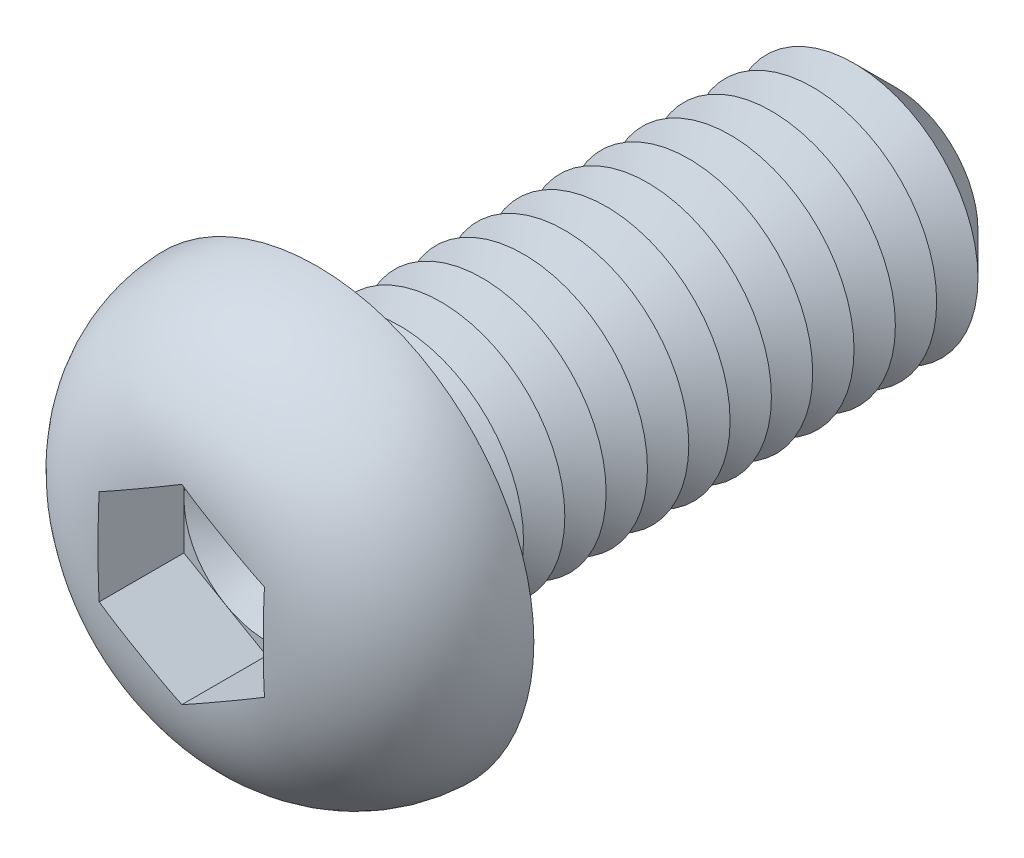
ISO-10303-21;
HEADER;
FILE_DESCRIPTION(('STEP AP214'),'2;1');
FILE_NAME('part.step','',(''),(''),'','','');
FILE_SCHEMA(('AUTOMOTIVE_DESIGN { 1 0 10303 214 1 1 1 1 }'));
ENDSEC;
DATA;
#1=APPLICATION_CONTEXT('core data for automotive mechanical design processes');
#2=APPLICATION_PROTOCOL_DEFINITION('international standard','automotive_design',2000,#1);
#3=PRODUCT_CONTEXT('',#1,'mechanical');
#4=PRODUCT('Part','Part','',(#3));
#5=PRODUCT_RELATED_PRODUCT_CATEGORY('part','',(#4));
#6=PRODUCT_DEFINITION_FORMATION('','',#4);
#7=PRODUCT_DEFINITION_CONTEXT('part definition',#1,'design');
#8=PRODUCT_DEFINITION('design','',#6,#7);
#9=PRODUCT_DEFINITION_SHAPE('','',#8);
#10=(LENGTH_UNIT() NAMED_UNIT(*) SI_UNIT(.MILLI.,.METRE.));
#11=(NAMED_UNIT(*) PLANE_ANGLE_UNIT() SI_UNIT($,.RADIAN.));
#12=(NAMED_UNIT(*) SI_UNIT($,.STERADIAN.) SOLID_ANGLE_UNIT());
#13=UNCERTAINTY_MEASURE_WITH_UNIT(LENGTH_MEASURE(1.E-05),#10,'distance_accuracy_value','');
#14=(GEOMETRIC_REPRESENTATION_CONTEXT(3) GLOBAL_UNCERTAINTY_ASSIGNED_CONTEXT((#13)) GLOBAL_UNIT_ASSIGNED_CONTEXT((#10,
#11,#12)) REPRESENTATION_CONTEXT('',''));
#15=CARTESIAN_POINT('',(0.,0.,0.));
#16=DIRECTION('',(0.,0.,1.));
#17=DIRECTION('',(1.,0.,0.));
#18=AXIS2_PLACEMENT_3D('',#15,#16,#17);
#19=CARTESIAN_POINT('',(0.,0.,1.22));
#20=DIRECTION('',(0.,0.,1.));
#21=DIRECTION('',(1.,0.,0.));
#22=AXIS2_PLACEMENT_3D('',#19,#20,#21);
#23=PLANE('',#22);
#24=CARTESIAN_POINT('',(0.,0.,1.22));
#25=DIRECTION('',(0.,0.,1.));
#26=DIRECTION('',(1.,0.,0.));
#27=AXIS2_PLACEMENT_3D('',#24,#25,#26);
#28=CIRCLE('',#27,2.);
#29=CARTESIAN_POINT('',(2.,0.,1.22));
#30=VERTEX_POINT('',#29);
#31=CARTESIAN_POINT('',(1.,1.73205080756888,1.22));
#32=VERTEX_POINT('',#31);
#33=EDGE_CURVE('E117',#30,#32,#28,.T.);
#34=ORIENTED_EDGE('',*,*,#33,.F.);
#35=DIRECTION('',(0.,1.,0.));
#36=VECTOR('',#35,1.);
#37=CARTESIAN_POINT('',(2.,-1.15470053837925,1.22));
#38=LINE('',#37,#36);
#39=CARTESIAN_POINT('',(2.,1.15470053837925,1.22));
#40=VERTEX_POINT('',#39);
#41=EDGE_CURVE('E140',#30,#40,#38,.T.);
#42=ORIENTED_EDGE('',*,*,#41,.T.);
#43=DIRECTION('',(-0.866025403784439,0.5,0.));
#44=VECTOR('',#43,1.);
#45=CARTESIAN_POINT('',(2.,1.15470053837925,1.22));
#46=LINE('',#45,#44);
#47=EDGE_CURVE('E136',#40,#32,#46,.T.);
#48=ORIENTED_EDGE('',*,*,#47,.T.);
#49=EDGE_LOOP('',(#34,#42,#48));
#50=FACE_BOUND('',#49,.T.);
#51=ADVANCED_FACE('F39',(#50),#23,.T.);
#52=CARTESIAN_POINT('',(0.,0.,1.22));
#53=DIRECTION('',(0.,0.,1.));
#54=DIRECTION('',(1.,0.,0.));
#55=AXIS2_PLACEMENT_3D('',#52,#53,#54);
#56=CIRCLE('',#55,2.);
#57=CARTESIAN_POINT('',(-1.,1.73205080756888,1.22));
#58=VERTEX_POINT('',#57);
#59=EDGE_CURVE('E11',#32,#58,#56,.T.);
#60=ORIENTED_EDGE('',*,*,#59,.F.);
#61=CARTESIAN_POINT('',(0.,2.3094010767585,1.22));
#62=VERTEX_POINT('',#61);
#63=EDGE_CURVE('E130',#32,#62,#46,.T.);
#64=ORIENTED_EDGE('',*,*,#63,.T.);
#65=DIRECTION('',(-0.866025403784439,-0.5,0.));
#66=VECTOR('',#65,1.);
#67=CARTESIAN_POINT('',(0.,2.3094010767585,1.22));
#68=LINE('',#67,#66);
#69=EDGE_CURVE('E131',#62,#58,#68,.T.);
#70=ORIENTED_EDGE('',*,*,#69,.T.);
#71=EDGE_LOOP('',(#60,#64,#70));
#72=FACE_BOUND('',#71,.T.);
#73=ADVANCED_FACE('F129',(#72),#23,.T.);
#74=CARTESIAN_POINT('',(-2.,0.,1.22));
#75=VERTEX_POINT('',#74);
#76=EDGE_CURVE('E49',#58,#75,#56,.T.);
#77=ORIENTED_EDGE('',*,*,#76,.F.);
#78=CARTESIAN_POINT('',(-2.,1.15470053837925,1.22));
#79=VERTEX_POINT('',#78);
#80=EDGE_CURVE('E143',#58,#79,#68,.T.);
#81=ORIENTED_EDGE('',*,*,#80,.T.);
#82=DIRECTION('',(0.,-1.,0.));
#83=VECTOR('',#82,1.);
#84=CARTESIAN_POINT('',(-2.,1.15470053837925,1.22));
#85=LINE('',#84,#83);
#86=EDGE_CURVE('E153',#79,#75,#85,.T.);
#87=ORIENTED_EDGE('',*,*,#86,.T.);
#88=EDGE_LOOP('',(#77,#81,#87));
#89=FACE_BOUND('',#88,.T.);
#90=ADVANCED_FACE('F271',(#89),#23,.T.);
#91=CARTESIAN_POINT('',(-1.,-1.73205080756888,1.22));
#92=VERTEX_POINT('',#91);
#93=EDGE_CURVE('E254',#75,#92,#56,.T.);
#94=ORIENTED_EDGE('',*,*,#93,.F.);
#95=CARTESIAN_POINT('',(-2.,-1.15470053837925,1.22));
#96=VERTEX_POINT('',#95);
#97=EDGE_CURVE('E152',#75,#96,#85,.T.);
#98=ORIENTED_EDGE('',*,*,#97,.T.);
#99=DIRECTION('',(0.866025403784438,-0.5,0.));
#100=VECTOR('',#99,1.);
#101=CARTESIAN_POINT('',(-2.,-1.15470053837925,1.22));
#102=LINE('',#101,#100);
#103=EDGE_CURVE('E158',#96,#92,#102,.T.);
#104=ORIENTED_EDGE('',*,*,#103,.T.);
#105=EDGE_LOOP('',(#94,#98,#104));
#106=FACE_BOUND('',#105,.T.);
#107=ADVANCED_FACE('F265',(#106),#23,.T.);
#108=CARTESIAN_POINT('',(0.999999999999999,-1.73205080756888,1.22));
#109=VERTEX_POINT('',#108);
#110=EDGE_CURVE('E56',#92,#109,#56,.T.);
#111=ORIENTED_EDGE('',*,*,#110,.F.);
#112=CARTESIAN_POINT('',(0.,-2.3094010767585,1.22));
#113=VERTEX_POINT('',#112);
#114=EDGE_CURVE('E157',#92,#113,#102,.T.);
#115=ORIENTED_EDGE('',*,*,#114,.T.);
#116=DIRECTION('',(0.866025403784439,0.5,0.));
#117=VECTOR('',#116,1.);
#118=CARTESIAN_POINT('',(0.,-2.3094010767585,1.22));
#119=LINE('',#118,#117);
#120=EDGE_CURVE('E163',#113,#109,#119,.T.);
#121=ORIENTED_EDGE('',*,*,#120,.T.);
#122=EDGE_LOOP('',(#111,#115,#121));
#123=FACE_BOUND('',#122,.T.);
#124=ADVANCED_FACE('F308',(#123),#23,.T.);
#125=CARTESIAN_POINT('',(0.,0.,-14.));
#126=DIRECTION('',(0.,0.,1.));
#127=DIRECTION('',(1.,0.,0.));
#128=AXIS2_PLACEMENT_3D('',#125,#126,#127);
#129=CYLINDRICAL_SURFACE('',#128,3.);
#130=CARTESIAN_POINT('',(0.,0.,-0.5));
#131=DIRECTION('',(0.,0.,1.));
#132=DIRECTION('',(1.,0.,0.));
#133=AXIS2_PLACEMENT_3D('',#130,#131,#132);
#134=CIRCLE('',#133,3.);
#135=CARTESIAN_POINT('',(3.,0.,-0.5));
#136=VERTEX_POINT('',#135);
#137=EDGE_CURVE('E242',#136,#136,#134,.F.);
#138=ORIENTED_EDGE('',*,*,#137,.T.);
#139=EDGE_LOOP('',(#138));
#140=FACE_BOUND('',#139,.T.);
#141=CARTESIAN_POINT('',(0.,0.,-1.));
#142=DIRECTION('',(0.,0.,1.));
#143=DIRECTION('',(1.,0.,0.));
#144=AXIS2_PLACEMENT_3D('',#141,#142,#143);
#145=CIRCLE('',#144,3.00000000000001);
#146=CARTESIAN_POINT('',(3.00000000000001,0.,-1.));
#147=VERTEX_POINT('',#146);
#148=EDGE_CURVE('E138',#147,#147,#145,.T.);
#149=ORIENTED_EDGE('',*,*,#148,.T.);
#150=EDGE_LOOP('',(#149));
#151=FACE_BOUND('',#150,.T.);
#152=ADVANCED_FACE('F309',(#140,#151),#129,.T.);
#153=CARTESIAN_POINT('',(0.,5.25,0.));
#154=DIRECTION('',(0.,0.,1.));
#155=DIRECTION('',(1.,0.,0.));
#156=AXIS2_PLACEMENT_3D('',#153,#154,#155);
#157=PLANE('',#156);
#158=CARTESIAN_POINT('',(0.,0.,0.));
#159=DIRECTION('',(0.,0.,1.));
#160=DIRECTION('',(1.,0.,0.));
#161=AXIS2_PLACEMENT_3D('',#158,#159,#160);
#162=CIRCLE('',#161,3.5);
#163=CARTESIAN_POINT('',(3.5,0.,0.));
#164=VERTEX_POINT('',#163);
#165=EDGE_CURVE('E245',#164,#164,#162,.T.);
#166=ORIENTED_EDGE('',*,*,#165,.T.);
#167=EDGE_LOOP('',(#166));
#168=FACE_BOUND('',#167,.T.);
#169=CARTESIAN_POINT('',(0.,0.,0.));
#170=DIRECTION('',(0.,0.,1.));
#171=DIRECTION('',(1.,0.,0.));
#172=AXIS2_PLACEMENT_3D('',#169,#170,#171);
#173=CIRCLE('',#172,5.25);
#174=CARTESIAN_POINT('',(5.25,0.,0.));
#175=VERTEX_POINT('',#174);
#176=EDGE_CURVE('E174',#175,#175,#173,.T.);
#177=ORIENTED_EDGE('',*,*,#176,.F.);
#178=EDGE_LOOP('',(#177));
#179=FACE_BOUND('',#178,.T.);
#180=ADVANCED_FACE('F312',(#168,#179),#157,.F.);
#181=CARTESIAN_POINT('',(0.,0.,-0.0999999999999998));
#182=DIRECTION('',(0.,0.,1.));
#183=DIRECTION('',(1.,0.,0.));
#184=AXIS2_PLACEMENT_3D('',#181,#182,#183);
#185=DEGENERATE_TOROIDAL_SURFACE('',#184,1.85147090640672,3.4,.T.);
#186=CARTESIAN_POINT('',(-2.0002,1.15458506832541,3.26900492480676));
#187=CARTESIAN_POINT('',(-1.91694658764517,1.20265144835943,3.27552708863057));
#188=CARTESIAN_POINT('',(-1.83362001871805,1.25076006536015,3.28041849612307));
#189=CARTESIAN_POINT('',(-1.66691146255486,1.34700929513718,3.28784569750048));
#190=CARTESIAN_POINT('',(-1.58352950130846,1.39514989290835,3.29038223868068));
#191=CARTESIAN_POINT('',(-1.4167967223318,1.49141310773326,3.29400753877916));
#192=CARTESIAN_POINT('',(-1.33344591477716,1.5395357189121,3.29509714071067));
#193=CARTESIAN_POINT('',(-1.16673007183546,1.63578915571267,3.29647051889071));
#194=CARTESIAN_POINT('',(-1.08336503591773,1.68391998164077,3.29675420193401));
#195=CARTESIAN_POINT('',(-0.916634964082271,1.78018163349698,3.29675420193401));
#196=CARTESIAN_POINT('',(-0.833269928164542,1.82831245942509,3.29647051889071));
#197=CARTESIAN_POINT('',(-0.666554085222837,1.92456589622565,3.29509714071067));
#198=CARTESIAN_POINT('',(-0.583203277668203,1.9726885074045,3.29400753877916));
#199=CARTESIAN_POINT('',(-0.416470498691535,2.06895172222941,3.29038223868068));
#200=CARTESIAN_POINT('',(-0.333088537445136,2.11709232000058,3.28784569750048));
#201=CARTESIAN_POINT('',(-0.166379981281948,2.21334154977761,3.28041849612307));
#202=CARTESIAN_POINT('',(-0.0830534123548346,2.26145016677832,3.27552708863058));
#203=CARTESIAN_POINT('',(0.000200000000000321,2.30951654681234,3.26900492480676));
#204=B_SPLINE_CURVE_WITH_KNOTS('',3,(#186,#187,#188,#189,#190,#191,#192,#193,#194,#195,#196,
#197,#198,#199,#200,#201,#202,#203),.UNSPECIFIED.,.F.,.F.,(4,2,2,2,2,2,2,2,4),(0.,
0.289010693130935,0.57792963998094,0.866680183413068,1.15546411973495,1.44424805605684,
1.73299859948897,2.02191754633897,2.31092823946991),.UNSPECIFIED.);
#205=CARTESIAN_POINT('',(-2.,1.15470053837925,3.26902062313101));
#206=VERTEX_POINT('',#205);
#207=CARTESIAN_POINT('',(1.70733705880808E-11,2.30940107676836,3.2690206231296));
#208=VERTEX_POINT('',#207);
#209=EDGE_CURVE('E196',#206,#208,#204,.T.);
#210=ORIENTED_EDGE('',*,*,#209,.T.);
#211=CARTESIAN_POINT('',(-0.000199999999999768,2.30951654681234,3.26900492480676));
#212=CARTESIAN_POINT('',(0.0830534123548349,2.26145016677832,3.27552708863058));
#213=CARTESIAN_POINT('',(0.166379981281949,2.21334154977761,3.28041849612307));
#214=CARTESIAN_POINT('',(0.333088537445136,2.11709232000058,3.28784569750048));
#215=CARTESIAN_POINT('',(0.416470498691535,2.06895172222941,3.29038223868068));
#216=CARTESIAN_POINT('',(0.583203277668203,1.9726885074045,3.29400753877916));
#217=CARTESIAN_POINT('',(0.666554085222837,1.92456589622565,3.29509714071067));
#218=CARTESIAN_POINT('',(0.833269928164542,1.82831245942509,3.29647051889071));
#219=CARTESIAN_POINT('',(0.916634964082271,1.78018163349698,3.29675420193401));
#220=CARTESIAN_POINT('',(1.08336503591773,1.68391998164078,3.29675420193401));
#221=CARTESIAN_POINT('',(1.16673007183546,1.63578915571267,3.29647051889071));
#222=CARTESIAN_POINT('',(1.33344591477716,1.5395357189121,3.29509714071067));
#223=CARTESIAN_POINT('',(1.4167967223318,1.49141310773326,3.29400753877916));
#224=CARTESIAN_POINT('',(1.58352950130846,1.39514989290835,3.29038223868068));
#225=CARTESIAN_POINT('',(1.66691146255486,1.34700929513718,3.28784569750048));
#226=CARTESIAN_POINT('',(1.83362001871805,1.25076006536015,3.28041849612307));
#227=CARTESIAN_POINT('',(1.91694658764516,1.20265144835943,3.27552708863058));
#228=CARTESIAN_POINT('',(2.0002,1.15458506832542,3.26900492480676));
#229=B_SPLINE_CURVE_WITH_KNOTS('',3,(#211,#212,#213,#214,#215,#216,#217,#218,#219,#220,#221,
#222,#223,#224,#225,#226,#227,#228),.UNSPECIFIED.,.F.,.F.,(4,2,2,2,2,2,2,2,4),(0.,
0.289010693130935,0.577929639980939,0.866680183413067,1.15546411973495,1.44424805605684,
1.73299859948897,2.02191754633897,2.31092823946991),.UNSPECIFIED.);
#230=CARTESIAN_POINT('',(2.,1.15470053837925,3.26902062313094));
#231=VERTEX_POINT('',#230);
#232=EDGE_CURVE('E225',#208,#231,#229,.T.);
#233=ORIENTED_EDGE('',*,*,#232,.T.);
#234=CARTESIAN_POINT('',(2.,0.,3.29675420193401));
#235=CARTESIAN_POINT('',(2.,-0.0838690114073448,3.29675159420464));
#236=CARTESIAN_POINT('',(2.,-0.167737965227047,3.29653427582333));
#237=CARTESIAN_POINT('',(2.,-0.335473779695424,3.29552217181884));
#238=CARTESIAN_POINT('',(2.,-0.419340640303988,3.29472737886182));
#239=CARTESIAN_POINT('',(2.,-0.587092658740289,3.29218243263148));
#240=CARTESIAN_POINT('',(2.,-0.670977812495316,3.29043194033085));
#241=CARTESIAN_POINT('',(2.,-0.838702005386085,3.28542814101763));
#242=CARTESIAN_POINT('',(2.,-0.922541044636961,3.28217483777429));
#243=CARTESIAN_POINT('',(2.,-1.173343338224,3.26923984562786));
#244=CARTESIAN_POINT('',(2.,-1.34017699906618,3.25638268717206));
#245=CARTESIAN_POINT('',(2.,-1.67225876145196,3.21731215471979));
#246=CARTESIAN_POINT('',(2.,-1.83750825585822,3.19111187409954));
#247=CARTESIAN_POINT('',(2.,-2.10571503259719,3.13417573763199));
#248=CARTESIAN_POINT('',(2.,-2.20973442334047,3.10844622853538));
#249=CARTESIAN_POINT('',(2.,-2.41562153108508,3.04936015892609));
#250=CARTESIAN_POINT('',(2.,-2.51748898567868,3.01600267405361));
#251=CARTESIAN_POINT('',(2.,-2.71832295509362,2.94120377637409));
#252=CARTESIAN_POINT('',(2.,-2.81728700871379,2.89975572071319));
#253=CARTESIAN_POINT('',(2.,-3.01134256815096,2.80859624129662));
#254=CARTESIAN_POINT('',(2.,-3.10643425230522,2.75888519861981));
#255=CARTESIAN_POINT('',(2.,-3.29253530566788,2.65079509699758));
#256=CARTESIAN_POINT('',(2.,-3.38350832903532,2.59235327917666));
#257=CARTESIAN_POINT('',(2.,-3.55964478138,2.46728791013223));
#258=CARTESIAN_POINT('',(2.,-3.64480873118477,2.40066509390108));
#259=CARTESIAN_POINT('',(2.,-3.80840353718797,2.25961603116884));
#260=CARTESIAN_POINT('',(2.,-3.88683504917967,2.18519054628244));
#261=CARTESIAN_POINT('',(2.,-4.03608847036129,2.02906828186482));
#262=CARTESIAN_POINT('',(2.,-4.106911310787,1.94737239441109));
#263=CARTESIAN_POINT('',(2.,-4.23287471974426,1.78665318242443));
#264=CARTESIAN_POINT('',(2.,-4.2888832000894,1.7083085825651));
#265=CARTESIAN_POINT('',(2.,-4.39372062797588,1.54691061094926));
#266=CARTESIAN_POINT('',(2.,-4.44254705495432,1.46385560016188));
#267=CARTESIAN_POINT('',(2.,-4.53249771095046,1.29375158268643));
#268=CARTESIAN_POINT('',(2.,-4.57362814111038,1.20670586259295));
#269=CARTESIAN_POINT('',(2.,-4.6478549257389,1.02924414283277));
#270=CARTESIAN_POINT('',(2.,-4.68094842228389,0.938826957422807));
#271=CARTESIAN_POINT('',(2.,-4.76413649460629,0.674747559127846));
#272=CARTESIAN_POINT('',(2.,-4.80368573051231,0.497625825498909));
#273=CARTESIAN_POINT('',(2.,-4.85179982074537,0.13932226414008));
#274=CARTESIAN_POINT('',(2.,-4.86036774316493,-0.0418591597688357));
#275=CARTESIAN_POINT('',(2.,-4.84642577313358,-0.399473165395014));
#276=CARTESIAN_POINT('',(2.,-4.82452156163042,-0.575929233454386));
#277=CARTESIAN_POINT('',(2.,-4.75142809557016,-0.922615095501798));
#278=CARTESIAN_POINT('',(2.,-4.70024536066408,-1.09284626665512));
#279=CARTESIAN_POINT('',(2.,-4.57020203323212,-1.42258491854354));
#280=CARTESIAN_POINT('',(2.,-4.49131097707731,-1.58208036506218));
#281=CARTESIAN_POINT('',(2.,-4.3083542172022,-1.8860021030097));
#282=CARTESIAN_POINT('',(2.,-4.2042742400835,-2.03041978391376));
#283=CARTESIAN_POINT('',(2.,-3.97174533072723,-2.30354399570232));
#284=CARTESIAN_POINT('',(2.,-3.84281347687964,-2.43183812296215));
#285=CARTESIAN_POINT('',(2.,-3.56631740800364,-2.66612298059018));
#286=CARTESIAN_POINT('',(2.,-3.41877418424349,-2.77213848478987));
#287=CARTESIAN_POINT('',(2.,-3.18261597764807,-2.91604941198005));
#288=CARTESIAN_POINT('',(2.,-3.09905663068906,-2.96247915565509));
#289=CARTESIAN_POINT('',(2.,-2.92856838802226,-3.04879370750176));
#290=CARTESIAN_POINT('',(2.,-2.84163827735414,-3.08867612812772));
#291=CARTESIAN_POINT('',(2.,-2.66495003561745,-3.16199567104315));
#292=CARTESIAN_POINT('',(2.,-2.57518752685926,-3.19542218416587));
#293=CARTESIAN_POINT('',(2.,-2.3936698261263,-3.25594506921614));
#294=CARTESIAN_POINT('',(2.,-2.30191676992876,-3.28304789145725));
#295=CARTESIAN_POINT('',(2.,-2.07265810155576,-3.34285611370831));
#296=CARTESIAN_POINT('',(2.,-1.93423373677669,-3.37205334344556));
#297=CARTESIAN_POINT('',(2.,-1.65546420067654,-3.419280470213));
#298=CARTESIAN_POINT('',(2.,-1.51511762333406,-3.43730169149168));
#299=CARTESIAN_POINT('',(2.,-1.23291689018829,-3.46473877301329));
#300=CARTESIAN_POINT('',(2.,-1.09105869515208,-3.47411015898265));
#301=CARTESIAN_POINT('',(2.,-0.807138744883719,-3.48717303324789));
#302=CARTESIAN_POINT('',(2.,-0.665077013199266,-3.4908651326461));
#303=CARTESIAN_POINT('',(2.,-0.451303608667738,-3.49429675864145));
#304=CARTESIAN_POINT('',(2.,-0.379602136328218,-3.49508825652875));
#305=CARTESIAN_POINT('',(2.,-0.236195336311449,-3.49619580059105));
#306=CARTESIAN_POINT('',(2.,-0.164490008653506,-3.49651184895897));
#307=CARTESIAN_POINT('',(2.,-0.0210718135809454,-3.49680708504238));
#308=CARTESIAN_POINT('',(2.,0.0506410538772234,-3.49678623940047));
#309=CARTESIAN_POINT('',(2.,0.194065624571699,-3.49639104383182));
#310=CARTESIAN_POINT('',(2.,0.265777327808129,-3.49601669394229));
#311=CARTESIAN_POINT('',(2.,0.480501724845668,-3.4941697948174));
#312=CARTESIAN_POINT('',(2.,0.623510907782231,-3.49197539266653));
#313=CARTESIAN_POINT('',(2.,0.909378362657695,-3.48318258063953));
#314=CARTESIAN_POINT('',(2.,1.05223667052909,-3.47658576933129));
#315=CARTESIAN_POINT('',(2.,1.30726724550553,-3.45800282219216));
#316=CARTESIAN_POINT('',(2.,1.41953767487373,-3.44745204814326));
#317=CARTESIAN_POINT('',(2.,1.64336701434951,-3.42020385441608));
#318=CARTESIAN_POINT('',(2.,1.75492585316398,-3.40350582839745));
#319=CARTESIAN_POINT('',(2.,1.97590795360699,-3.36293007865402));
#320=CARTESIAN_POINT('',(2.,2.08534088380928,-3.33910600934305));
#321=CARTESIAN_POINT('',(2.,2.30216001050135,-3.28336687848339));
#322=CARTESIAN_POINT('',(2.,2.40954602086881,-3.25145108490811));
#323=CARTESIAN_POINT('',(2.,2.62289868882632,-3.1784271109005));
#324=CARTESIAN_POINT('',(2.,2.72882262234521,-3.13719314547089));
#325=CARTESIAN_POINT('',(2.,2.93660837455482,-3.04548652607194));
#326=CARTESIAN_POINT('',(2.,3.03847031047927,-2.99501413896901));
#327=CARTESIAN_POINT('',(2.,3.23738754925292,-2.88459171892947));
#328=CARTESIAN_POINT('',(2.,3.33442546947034,-2.82461027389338));
#329=CARTESIAN_POINT('',(2.,3.52225616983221,-2.69545434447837));
#330=CARTESIAN_POINT('',(2.,3.61304636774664,-2.62627609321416));
#331=CARTESIAN_POINT('',(2.,3.77958578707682,-2.48563135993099));
#332=CARTESIAN_POINT('',(2.,3.85595570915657,-2.41489922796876));
#333=CARTESIAN_POINT('',(2.,4.00175744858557,-2.26661746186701));
#334=CARTESIAN_POINT('',(2.,4.07118992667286,-2.18906847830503));
#335=CARTESIAN_POINT('',(2.,4.20228235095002,-2.02784942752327));
#336=CARTESIAN_POINT('',(2.,4.26395450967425,-1.94418931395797));
#337=CARTESIAN_POINT('',(2.,4.37897455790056,-1.7713710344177));
#338=CARTESIAN_POINT('',(2.,4.43232318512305,-1.68221335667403));
#339=CARTESIAN_POINT('',(2.,4.5685109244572,-1.42722170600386));
#340=CARTESIAN_POINT('',(2.,4.64167742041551,-1.25607726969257));
#341=CARTESIAN_POINT('',(2.,4.75695354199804,-0.903699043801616));
#342=CARTESIAN_POINT('',(2.,4.79906366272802,-0.722465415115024));
#343=CARTESIAN_POINT('',(2.,4.84982785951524,-0.362243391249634));
#344=CARTESIAN_POINT('',(2.,4.85966759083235,-0.183422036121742));
#345=CARTESIAN_POINT('',(2.,4.84889099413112,0.17327689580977));
#346=CARTESIAN_POINT('',(2.,4.82827907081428,0.351154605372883));
#347=CARTESIAN_POINT('',(2.,4.75760776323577,0.699332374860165));
#348=CARTESIAN_POINT('',(2.,4.70780624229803,0.869684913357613));
#349=CARTESIAN_POINT('',(2.,4.58058971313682,1.199716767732));
#350=CARTESIAN_POINT('',(2.,4.50317623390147,1.35939667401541));
#351=CARTESIAN_POINT('',(2.,4.32230037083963,1.66542907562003));
#352=CARTESIAN_POINT('',(2.,4.21858077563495,1.81162931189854));
#353=CARTESIAN_POINT('',(2.,3.98879583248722,2.08527000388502));
#354=CARTESIAN_POINT('',(2.,3.86272429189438,2.21270524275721));
#355=CARTESIAN_POINT('',(2.,3.58743550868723,2.45020985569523));
#356=CARTESIAN_POINT('',(2.,3.43756474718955,2.55951924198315));
#357=CARTESIAN_POINT('',(2.,3.12282273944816,2.7535430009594));
#358=CARTESIAN_POINT('',(2.,2.95795742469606,2.83826704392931));
#359=CARTESIAN_POINT('',(2.,2.67096435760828,2.96064273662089));
#360=CARTESIAN_POINT('',(2.,2.55150855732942,3.00473766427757));
#361=CARTESIAN_POINT('',(2.,2.30905936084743,3.08191633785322));
#362=CARTESIAN_POINT('',(2.,2.18606487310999,3.11499664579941));
#363=CARTESIAN_POINT('',(2.,1.93761764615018,3.17114962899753));
#364=CARTESIAN_POINT('',(2.,1.8121607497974,3.19420352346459));
#365=CARTESIAN_POINT('',(2.,1.56000755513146,3.23170431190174));
#366=CARTESIAN_POINT('',(2.,1.43331126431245,3.24615125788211));
#367=CARTESIAN_POINT('',(2.,1.19785080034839,3.26676473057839));
#368=CARTESIAN_POINT('',(2.,1.08915974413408,3.27383022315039));
#369=CARTESIAN_POINT('',(2.,0.87159878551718,3.28448481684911));
#370=CARTESIAN_POINT('',(2.,0.762728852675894,3.28807324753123));
#371=CARTESIAN_POINT('',(2.,0.54488171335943,3.29312180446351));
#372=CARTESIAN_POINT('',(2.,0.435904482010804,3.29458062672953));
#373=CARTESIAN_POINT('',(2.,0.217951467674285,3.29639847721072));
#374=CARTESIAN_POINT('',(2.,0.108975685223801,3.29675759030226));
#375=CARTESIAN_POINT('',(2.,0.,3.29675420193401));
#376=B_SPLINE_CURVE_WITH_KNOTS('',3,(#234,#235,#236,#237,#238,#239,#240,#241,#242,#243,#244,
#245,#246,#247,#248,#249,#250,#251,#252,#253,#254,#255,#256,#257,#258,#259,#260,#261,#262,#263,
#264,#265,#266,#267,#268,#269,#270,#271,#272,#273,#274,#275,#276,#277,#278,#279,#280,#281,#282,
#283,#284,#285,#286,#287,#288,#289,#290,#291,#292,#293,#294,#295,#296,#297,#298,#299,#300,#301,
#302,#303,#304,#305,#306,#307,#308,#309,#310,#311,#312,#313,#314,#315,#316,#317,#318,#319,#320,
#321,#322,#323,#324,#325,#326,#327,#328,#329,#330,#331,#332,#333,#334,#335,#336,#337,#338,#339,
#340,#341,#342,#343,#344,#345,#346,#347,#348,#349,#350,#351,#352,#353,#354,#355,#356,#357,#358,
#359,#360,#361,#362,#363,#364,#365,#366,#367,#368,#369,#370,#371,#372,#373,#374,#375),
.UNSPECIFIED.,.T.,.F.,(4,2,2,2,2,2,2,2,2,2,2,2,2,2,2,2,2,2,2,2,2,2,2,2,2,2,2,2,2,2,2,2,2,2,2,2,
2,2,2,2,2,2,2,2,2,2,2,2,2,2,2,2,2,2,2,2,2,2,2,2,2,2,2,2,2,2,2,2,2,2,4),(0.,0.251606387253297,
0.503215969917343,0.754914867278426,1.00661313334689,1.50825543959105,2.00940643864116,
2.33061510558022,2.65186271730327,2.97337521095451,3.29487288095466,3.61880390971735,
3.94270585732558,4.26657621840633,4.59040689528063,4.8789527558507,5.16759964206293,
5.45601293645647,5.74452864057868,6.28608750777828,6.82759274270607,7.35848716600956,
7.8892634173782,8.42062506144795,8.95228851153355,9.49557283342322,10.0382497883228,
10.3247866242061,10.6114277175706,10.8985359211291,11.1853499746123,11.6091713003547,
12.0333212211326,12.4596400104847,12.8859129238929,13.1010304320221,13.316146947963,
13.5312847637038,13.746422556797,14.1754765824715,14.6043748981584,14.9425387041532,
15.2807358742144,15.6164481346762,15.9521907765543,16.2927694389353,16.6333382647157,
16.9750565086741,17.3169151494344,17.6287548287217,17.9405647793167,18.2518777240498,
18.5631630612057,19.1185081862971,19.6738444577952,20.20853386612,20.7431459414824,
21.2731049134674,21.8030345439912,22.3383600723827,22.8738341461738,23.4279697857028,
23.9818871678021,24.3633752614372,24.7449823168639,25.1273011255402,25.5096176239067,
25.8363061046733,26.163057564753,26.4900090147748,26.8169352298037),.UNSPECIFIED.);
#377=CARTESIAN_POINT('',(2.,-1.15470053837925,3.26902062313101));
#378=VERTEX_POINT('',#377);
#379=EDGE_CURVE('E234',#231,#378,#376,.T.);
#380=ORIENTED_EDGE('',*,*,#379,.T.);
#381=CARTESIAN_POINT('',(2.0002,-1.15458506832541,3.26900492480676));
#382=CARTESIAN_POINT('',(1.91694658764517,-1.20265144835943,3.27552708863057));
#383=CARTESIAN_POINT('',(1.83362001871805,-1.25076006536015,3.28041849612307));
#384=CARTESIAN_POINT('',(1.66691146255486,-1.34700929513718,3.28784569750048));
#385=CARTESIAN_POINT('',(1.58352950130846,-1.39514989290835,3.29038223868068));
#386=CARTESIAN_POINT('',(1.4167967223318,-1.49141310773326,3.29400753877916));
#387=CARTESIAN_POINT('',(1.33344591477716,-1.5395357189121,3.29509714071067));
#388=CARTESIAN_POINT('',(1.16673007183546,-1.63578915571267,3.29647051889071));
#389=CARTESIAN_POINT('',(1.08336503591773,-1.68391998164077,3.29675420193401));
#390=CARTESIAN_POINT('',(0.916634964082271,-1.78018163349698,3.29675420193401));
#391=CARTESIAN_POINT('',(0.833269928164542,-1.82831245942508,3.29647051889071));
#392=CARTESIAN_POINT('',(0.666554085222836,-1.92456589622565,3.29509714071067));
#393=CARTESIAN_POINT('',(0.583203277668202,-1.97268850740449,3.29400753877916));
#394=CARTESIAN_POINT('',(0.416470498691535,-2.06895172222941,3.29038223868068));
#395=CARTESIAN_POINT('',(0.333088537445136,-2.11709232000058,3.28784569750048));
#396=CARTESIAN_POINT('',(0.166379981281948,-2.2133415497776,3.28041849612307));
#397=CARTESIAN_POINT('',(0.0830534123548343,-2.26145016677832,3.27552708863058));
#398=CARTESIAN_POINT('',(-0.000200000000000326,-2.30951654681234,3.26900492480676));
#399=B_SPLINE_CURVE_WITH_KNOTS('',3,(#381,#382,#383,#384,#385,#386,#387,#388,#389,#390,#391,
#392,#393,#394,#395,#396,#397,#398),.UNSPECIFIED.,.F.,.F.,(4,2,2,2,2,2,2,2,4),(0.,
0.289010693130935,0.57792963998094,0.866680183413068,1.15546411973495,1.44424805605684,
1.73299859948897,2.02191754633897,2.31092823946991),.UNSPECIFIED.);
#400=CARTESIAN_POINT('',(0.,-2.3094010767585,3.26902062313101));
#401=VERTEX_POINT('',#400);
#402=EDGE_CURVE('E283',#378,#401,#399,.T.);
#403=ORIENTED_EDGE('',*,*,#402,.T.);
#404=CARTESIAN_POINT('',(0.000199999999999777,-2.30951654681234,3.26900492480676));
#405=CARTESIAN_POINT('',(-0.083053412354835,-2.26145016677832,3.27552708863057));
#406=CARTESIAN_POINT('',(-0.166379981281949,-2.21334154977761,3.28041849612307));
#407=CARTESIAN_POINT('',(-0.333088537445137,-2.11709232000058,3.28784569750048));
#408=CARTESIAN_POINT('',(-0.416470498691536,-2.06895172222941,3.29038223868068));
#409=CARTESIAN_POINT('',(-0.583203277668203,-1.97268850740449,3.29400753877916));
#410=CARTESIAN_POINT('',(-0.666554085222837,-1.92456589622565,3.29509714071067));
#411=CARTESIAN_POINT('',(-0.833269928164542,-1.82831245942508,3.29647051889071));
#412=CARTESIAN_POINT('',(-0.916634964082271,-1.78018163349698,3.29675420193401));
#413=CARTESIAN_POINT('',(-1.08336503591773,-1.68391998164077,3.29675420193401));
#414=CARTESIAN_POINT('',(-1.16673007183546,-1.63578915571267,3.29647051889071));
#415=CARTESIAN_POINT('',(-1.33344591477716,-1.5395357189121,3.29509714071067));
#416=CARTESIAN_POINT('',(-1.4167967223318,-1.49141310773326,3.29400753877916));
#417=CARTESIAN_POINT('',(-1.58352950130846,-1.39514989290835,3.29038223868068));
#418=CARTESIAN_POINT('',(-1.66691146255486,-1.34700929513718,3.28784569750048));
#419=CARTESIAN_POINT('',(-1.83362001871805,-1.25076006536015,3.28041849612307));
#420=CARTESIAN_POINT('',(-1.91694658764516,-1.20265144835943,3.27552708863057));
#421=CARTESIAN_POINT('',(-2.0002,-1.15458506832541,3.26900492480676));
#422=B_SPLINE_CURVE_WITH_KNOTS('',3,(#404,#405,#406,#407,#408,#409,#410,#411,#412,#413,#414,
#415,#416,#417,#418,#419,#420,#421),.UNSPECIFIED.,.F.,.F.,(4,2,2,2,2,2,2,2,4),(0.,
0.289010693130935,0.577929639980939,0.866680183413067,1.15546411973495,1.44424805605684,
1.73299859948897,2.02191754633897,2.31092823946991),.UNSPECIFIED.);
#423=CARTESIAN_POINT('',(-2.,-1.15470053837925,3.26902062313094));
#424=VERTEX_POINT('',#423);
#425=EDGE_CURVE('E278',#401,#424,#422,.T.);
#426=ORIENTED_EDGE('',*,*,#425,.T.);
#427=CARTESIAN_POINT('',(-2.,0.,3.29675420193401));
#428=CARTESIAN_POINT('',(-2.,0.0838690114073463,3.29675159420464));
#429=CARTESIAN_POINT('',(-2.,0.167737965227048,3.29653427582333));
#430=CARTESIAN_POINT('',(-2.,0.335473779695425,3.29552217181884));
#431=CARTESIAN_POINT('',(-2.,0.41934064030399,3.29472737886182));
#432=CARTESIAN_POINT('',(-2.,0.58709265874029,3.29218243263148));
#433=CARTESIAN_POINT('',(-2.,0.670977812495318,3.29043194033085));
#434=CARTESIAN_POINT('',(-2.,0.838702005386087,3.28542814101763));
#435=CARTESIAN_POINT('',(-2.,0.922541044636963,3.28217483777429));
#436=CARTESIAN_POINT('',(-2.,1.173343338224,3.26923984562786));
#437=CARTESIAN_POINT('',(-2.,1.34017699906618,3.25638268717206));
#438=CARTESIAN_POINT('',(-2.,1.67225876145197,3.21731215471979));
#439=CARTESIAN_POINT('',(-2.,1.83750825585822,3.19111187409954));
#440=CARTESIAN_POINT('',(-2.,2.10571503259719,3.13417573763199));
#441=CARTESIAN_POINT('',(-2.,2.20973442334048,3.10844622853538));
#442=CARTESIAN_POINT('',(-2.,2.41562153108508,3.04936015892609));
#443=CARTESIAN_POINT('',(-2.,2.51748898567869,3.01600267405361));
#444=CARTESIAN_POINT('',(-2.,2.71832295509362,2.94120377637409));
#445=CARTESIAN_POINT('',(-2.,2.81728700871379,2.89975572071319));
#446=CARTESIAN_POINT('',(-2.,3.01134256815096,2.80859624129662));
#447=CARTESIAN_POINT('',(-2.,3.10643425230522,2.75888519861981));
#448=CARTESIAN_POINT('',(-2.,3.29253530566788,2.65079509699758));
#449=CARTESIAN_POINT('',(-2.,3.38350832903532,2.59235327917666));
#450=CARTESIAN_POINT('',(-2.,3.55964478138,2.46728791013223));
#451=CARTESIAN_POINT('',(-2.,3.64480873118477,2.40066509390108));
#452=CARTESIAN_POINT('',(-2.,3.80840353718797,2.25961603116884));
#453=CARTESIAN_POINT('',(-2.,3.88683504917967,2.18519054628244));
#454=CARTESIAN_POINT('',(-2.,4.03608847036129,2.02906828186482));
#455=CARTESIAN_POINT('',(-2.,4.106911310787,1.94737239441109));
#456=CARTESIAN_POINT('',(-2.,4.23287471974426,1.78665318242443));
#457=CARTESIAN_POINT('',(-2.,4.2888832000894,1.7083085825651));
#458=CARTESIAN_POINT('',(-2.,4.39372062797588,1.54691061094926));
#459=CARTESIAN_POINT('',(-2.,4.44254705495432,1.46385560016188));
#460=CARTESIAN_POINT('',(-2.,4.53249771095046,1.29375158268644));
#461=CARTESIAN_POINT('',(-2.,4.57362814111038,1.20670586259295));
#462=CARTESIAN_POINT('',(-2.,4.6478549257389,1.02924414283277));
#463=CARTESIAN_POINT('',(-2.,4.68094842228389,0.938826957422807));
#464=CARTESIAN_POINT('',(-2.,4.76413649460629,0.674747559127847));
#465=CARTESIAN_POINT('',(-2.,4.80368573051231,0.497625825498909));
#466=CARTESIAN_POINT('',(-2.,4.85179982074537,0.13932226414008));
#467=CARTESIAN_POINT('',(-2.,4.86036774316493,-0.0418591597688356));
#468=CARTESIAN_POINT('',(-2.,4.84642577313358,-0.399473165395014));
#469=CARTESIAN_POINT('',(-2.,4.82452156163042,-0.575929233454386));
#470=CARTESIAN_POINT('',(-2.,4.75142809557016,-0.922615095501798));
#471=CARTESIAN_POINT('',(-2.,4.70024536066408,-1.09284626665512));
#472=CARTESIAN_POINT('',(-2.,4.57020203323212,-1.42258491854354));
#473=CARTESIAN_POINT('',(-2.,4.49131097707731,-1.58208036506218));
#474=CARTESIAN_POINT('',(-2.,4.3083542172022,-1.8860021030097));
#475=CARTESIAN_POINT('',(-2.,4.2042742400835,-2.03041978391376));
#476=CARTESIAN_POINT('',(-2.,3.97174533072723,-2.30354399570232));
#477=CARTESIAN_POINT('',(-2.,3.84281347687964,-2.43183812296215));
#478=CARTESIAN_POINT('',(-2.,3.56631740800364,-2.66612298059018));
#479=CARTESIAN_POINT('',(-2.,3.41877418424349,-2.77213848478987));
#480=CARTESIAN_POINT('',(-2.,3.18261597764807,-2.91604941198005));
#481=CARTESIAN_POINT('',(-2.,3.09905663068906,-2.96247915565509));
#482=CARTESIAN_POINT('',(-2.,2.92856838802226,-3.04879370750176));
#483=CARTESIAN_POINT('',(-2.,2.84163827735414,-3.08867612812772));
#484=CARTESIAN_POINT('',(-2.,2.66495003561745,-3.16199567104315));
#485=CARTESIAN_POINT('',(-2.,2.57518752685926,-3.19542218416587));
#486=CARTESIAN_POINT('',(-2.,2.3936698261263,-3.25594506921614));
#487=CARTESIAN_POINT('',(-2.,2.30191676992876,-3.28304789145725));
#488=CARTESIAN_POINT('',(-2.,2.07265810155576,-3.34285611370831));
#489=CARTESIAN_POINT('',(-2.,1.93423373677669,-3.37205334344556));
#490=CARTESIAN_POINT('',(-2.,1.65546420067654,-3.419280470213));
#491=CARTESIAN_POINT('',(-2.,1.51511762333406,-3.43730169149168));
#492=CARTESIAN_POINT('',(-2.,1.23291689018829,-3.46473877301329));
#493=CARTESIAN_POINT('',(-2.,1.09105869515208,-3.47411015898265));
#494=CARTESIAN_POINT('',(-2.,0.807138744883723,-3.48717303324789));
#495=CARTESIAN_POINT('',(-2.,0.66507701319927,-3.4908651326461));
#496=CARTESIAN_POINT('',(-2.,0.451303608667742,-3.49429675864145));
#497=CARTESIAN_POINT('',(-2.,0.379602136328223,-3.49508825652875));
#498=CARTESIAN_POINT('',(-2.,0.236195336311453,-3.49619580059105));
#499=CARTESIAN_POINT('',(-2.,0.16449000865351,-3.49651184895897));
#500=CARTESIAN_POINT('',(-2.,0.0210718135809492,-3.49680708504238));
#501=CARTESIAN_POINT('',(-2.,-0.0506410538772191,-3.49678623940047));
#502=CARTESIAN_POINT('',(-2.,-0.194065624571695,-3.49639104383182));
#503=CARTESIAN_POINT('',(-2.,-0.265777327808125,-3.49601669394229));
#504=CARTESIAN_POINT('',(-2.,-0.480501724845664,-3.4941697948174));
#505=CARTESIAN_POINT('',(-2.,-0.623510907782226,-3.49197539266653));
#506=CARTESIAN_POINT('',(-2.,-0.909378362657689,-3.48318258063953));
#507=CARTESIAN_POINT('',(-2.,-1.05223667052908,-3.47658576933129));
#508=CARTESIAN_POINT('',(-2.,-1.30726724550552,-3.45800282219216));
#509=CARTESIAN_POINT('',(-2.,-1.41953767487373,-3.44745204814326));
#510=CARTESIAN_POINT('',(-2.,-1.6433670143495,-3.42020385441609));
#511=CARTESIAN_POINT('',(-2.,-1.75492585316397,-3.40350582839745));
#512=CARTESIAN_POINT('',(-2.,-1.97590795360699,-3.36293007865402));
#513=CARTESIAN_POINT('',(-2.,-2.08534088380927,-3.33910600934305));
#514=CARTESIAN_POINT('',(-2.,-2.30216001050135,-3.28336687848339));
#515=CARTESIAN_POINT('',(-2.,-2.4095460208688,-3.25145108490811));
#516=CARTESIAN_POINT('',(-2.,-2.62289868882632,-3.1784271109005));
#517=CARTESIAN_POINT('',(-2.,-2.72882262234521,-3.13719314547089));
#518=CARTESIAN_POINT('',(-2.,-2.93660837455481,-3.04548652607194));
#519=CARTESIAN_POINT('',(-2.,-3.03847031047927,-2.99501413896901));
#520=CARTESIAN_POINT('',(-2.,-3.23738754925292,-2.88459171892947));
#521=CARTESIAN_POINT('',(-2.,-3.33442546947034,-2.82461027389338));
#522=CARTESIAN_POINT('',(-2.,-3.52225616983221,-2.69545434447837));
#523=CARTESIAN_POINT('',(-2.,-3.61304636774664,-2.62627609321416));
#524=CARTESIAN_POINT('',(-2.,-3.77958578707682,-2.48563135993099));
#525=CARTESIAN_POINT('',(-2.,-3.85595570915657,-2.41489922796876));
#526=CARTESIAN_POINT('',(-2.,-4.00175744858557,-2.26661746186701));
#527=CARTESIAN_POINT('',(-2.,-4.07118992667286,-2.18906847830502));
#528=CARTESIAN_POINT('',(-2.,-4.20228235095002,-2.02784942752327));
#529=CARTESIAN_POINT('',(-2.,-4.26395450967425,-1.94418931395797));
#530=CARTESIAN_POINT('',(-2.,-4.37897455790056,-1.7713710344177));
#531=CARTESIAN_POINT('',(-2.,-4.43232318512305,-1.68221335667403));
#532=CARTESIAN_POINT('',(-2.,-4.5685109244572,-1.42722170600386));
#533=CARTESIAN_POINT('',(-2.,-4.64167742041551,-1.25607726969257));
#534=CARTESIAN_POINT('',(-2.,-4.75695354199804,-0.903699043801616));
#535=CARTESIAN_POINT('',(-2.,-4.79906366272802,-0.722465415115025));
#536=CARTESIAN_POINT('',(-2.,-4.84982785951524,-0.362243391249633));
#537=CARTESIAN_POINT('',(-2.,-4.85966759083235,-0.18342203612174));
#538=CARTESIAN_POINT('',(-2.,-4.84889099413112,0.173276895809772));
#539=CARTESIAN_POINT('',(-2.,-4.82827907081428,0.351154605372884));
#540=CARTESIAN_POINT('',(-2.,-4.75760776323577,0.699332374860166));
#541=CARTESIAN_POINT('',(-2.,-4.70780624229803,0.869684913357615));
#542=CARTESIAN_POINT('',(-2.,-4.58058971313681,1.199716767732));
#543=CARTESIAN_POINT('',(-2.,-4.50317623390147,1.35939667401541));
#544=CARTESIAN_POINT('',(-2.,-4.32230037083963,1.66542907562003));
#545=CARTESIAN_POINT('',(-2.,-4.21858077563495,1.81162931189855));
#546=CARTESIAN_POINT('',(-2.,-3.98879583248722,2.08527000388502));
#547=CARTESIAN_POINT('',(-2.,-3.86272429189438,2.21270524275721));
#548=CARTESIAN_POINT('',(-2.,-3.58743550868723,2.45020985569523));
#549=CARTESIAN_POINT('',(-2.,-3.43756474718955,2.55951924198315));
#550=CARTESIAN_POINT('',(-2.,-3.12282273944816,2.7535430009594));
#551=CARTESIAN_POINT('',(-2.,-2.95795742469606,2.8382670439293));
#552=CARTESIAN_POINT('',(-2.,-2.67096435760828,2.96064273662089));
#553=CARTESIAN_POINT('',(-2.,-2.55150855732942,3.00473766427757));
#554=CARTESIAN_POINT('',(-2.,-2.30905936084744,3.08191633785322));
#555=CARTESIAN_POINT('',(-2.,-2.18606487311,3.11499664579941));
#556=CARTESIAN_POINT('',(-2.,-1.93761764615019,3.17114962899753));
#557=CARTESIAN_POINT('',(-2.,-1.81216074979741,3.19420352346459));
#558=CARTESIAN_POINT('',(-2.,-1.56000755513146,3.23170431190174));
#559=CARTESIAN_POINT('',(-2.,-1.43331126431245,3.24615125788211));
#560=CARTESIAN_POINT('',(-2.,-1.19785080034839,3.26676473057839));
#561=CARTESIAN_POINT('',(-2.,-1.08915974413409,3.27383022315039));
#562=CARTESIAN_POINT('',(-2.,-0.871598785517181,3.28448481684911));
#563=CARTESIAN_POINT('',(-2.,-0.762728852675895,3.28807324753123));
#564=CARTESIAN_POINT('',(-2.,-0.54488171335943,3.29312180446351));
#565=CARTESIAN_POINT('',(-2.,-0.435904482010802,3.29458062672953));
#566=CARTESIAN_POINT('',(-2.,-0.217951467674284,3.29639847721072));
#567=CARTESIAN_POINT('',(-2.,-0.108975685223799,3.29675759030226));
#568=CARTESIAN_POINT('',(-2.,0.,3.29675420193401));
#569=B_SPLINE_CURVE_WITH_KNOTS('',3,(#427,#428,#429,#430,#431,#432,#433,#434,#435,#436,#437,
#438,#439,#440,#441,#442,#443,#444,#445,#446,#447,#448,#449,#450,#451,#452,#453,#454,#455,#456,
#457,#458,#459,#460,#461,#462,#463,#464,#465,#466,#467,#468,#469,#470,#471,#472,#473,#474,#475,
#476,#477,#478,#479,#480,#481,#482,#483,#484,#485,#486,#487,#488,#489,#490,#491,#492,#493,#494,
#495,#496,#497,#498,#499,#500,#501,#502,#503,#504,#505,#506,#507,#508,#509,#510,#511,#512,#513,
#514,#515,#516,#517,#518,#519,#520,#521,#522,#523,#524,#525,#526,#527,#528,#529,#530,#531,#532,
#533,#534,#535,#536,#537,#538,#539,#540,#541,#542,#543,#544,#545,#546,#547,#548,#549,#550,#551,
#552,#553,#554,#555,#556,#557,#558,#559,#560,#561,#562,#563,#564,#565,#566,#567,#568),
.UNSPECIFIED.,.T.,.F.,(4,2,2,2,2,2,2,2,2,2,2,2,2,2,2,2,2,2,2,2,2,2,2,2,2,2,2,2,2,2,2,2,2,2,2,2,
2,2,2,2,2,2,2,2,2,2,2,2,2,2,2,2,2,2,2,2,2,2,2,2,2,2,2,2,2,2,2,2,2,2,4),(0.,0.251606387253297,
0.503215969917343,0.754914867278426,1.0066131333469,1.50825543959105,2.00940643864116,
2.33061510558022,2.65186271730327,2.97337521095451,3.29487288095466,3.61880390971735,
3.94270585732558,4.26657621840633,4.59040689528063,4.8789527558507,5.16759964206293,
5.45601293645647,5.74452864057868,6.28608750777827,6.82759274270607,7.35848716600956,
7.88926341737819,8.42062506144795,8.95228851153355,9.49557283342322,10.0382497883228,
10.3247866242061,10.6114277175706,10.8985359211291,11.1853499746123,11.6091713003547,
12.0333212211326,12.4596400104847,12.8859129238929,13.1010304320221,13.316146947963,
13.5312847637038,13.746422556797,14.1754765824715,14.6043748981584,14.9425387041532,
15.2807358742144,15.6164481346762,15.9521907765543,16.2927694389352,16.6333382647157,
16.9750565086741,17.3169151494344,17.6287548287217,17.9405647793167,18.2518777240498,
18.5631630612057,19.1185081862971,19.6738444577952,20.20853386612,20.7431459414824,
21.2731049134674,21.8030345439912,22.3383600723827,22.8738341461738,23.4279697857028,
23.981887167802,24.3633752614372,24.7449823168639,25.1273011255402,25.5096176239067,
25.8363061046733,26.163057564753,26.4900090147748,26.8169352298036),.UNSPECIFIED.);
#570=EDGE_CURVE('E205',#424,#206,#569,.T.);
#571=ORIENTED_EDGE('',*,*,#570,.T.);
#572=EDGE_LOOP('',(#210,#233,#380,#403,#426,#571));
#573=FACE_BOUND('',#572,.T.);
#574=ORIENTED_EDGE('',*,*,#176,.T.);
#575=EDGE_LOOP('',(#574));
#576=FACE_BOUND('',#575,.T.);
#577=ADVANCED_FACE('F210',(#573,#576),#185,.T.);
#578=CARTESIAN_POINT('',(2.,1.15470053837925,1.22));
#579=DIRECTION('',(0.5,0.866025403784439,0.));
#580=DIRECTION('',(-0.866025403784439,0.5,0.));
#581=AXIS2_PLACEMENT_3D('',#578,#579,#580);
#582=PLANE('',#581);
#583=DIRECTION('',(0.,0.,1.));
#584=VECTOR('',#583,1.);
#585=CARTESIAN_POINT('',(0.,2.3094010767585,1.22));
#586=LINE('',#585,#584);
#587=EDGE_CURVE('E64',#62,#208,#586,.T.);
#588=ORIENTED_EDGE('',*,*,#587,.F.);
#589=ORIENTED_EDGE('',*,*,#63,.F.);
#590=ORIENTED_EDGE('',*,*,#47,.F.);
#591=DIRECTION('',(0.,0.,1.));
#592=VECTOR('',#591,1.);
#593=CARTESIAN_POINT('',(2.,1.15470053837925,1.22));
#594=LINE('',#593,#592);
#595=EDGE_CURVE('E171',#40,#231,#594,.T.);
#596=ORIENTED_EDGE('',*,*,#595,.T.);
#597=ORIENTED_EDGE('',*,*,#232,.F.);
#598=EDGE_LOOP('',(#588,#589,#590,#596,#597));
#599=FACE_BOUND('',#598,.T.);
#600=ADVANCED_FACE('F134',(#599),#582,.F.);
#601=CARTESIAN_POINT('',(2.,-1.15470053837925,1.22));
#602=DIRECTION('',(1.,0.,0.));
#603=DIRECTION('',(0.,1.,0.));
#604=AXIS2_PLACEMENT_3D('',#601,#602,#603);
#605=PLANE('',#604);
#606=ORIENTED_EDGE('',*,*,#595,.F.);
#607=ORIENTED_EDGE('',*,*,#41,.F.);
#608=CARTESIAN_POINT('',(2.,-1.15470053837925,1.22));
#609=VERTEX_POINT('',#608);
#610=EDGE_CURVE('E167',#609,#30,#38,.T.);
#611=ORIENTED_EDGE('',*,*,#610,.F.);
#612=DIRECTION('',(0.,0.,1.));
#613=VECTOR('',#612,1.);
#614=CARTESIAN_POINT('',(2.,-1.15470053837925,1.22));
#615=LINE('',#614,#613);
#616=EDGE_CURVE('E175',#609,#378,#615,.T.);
#617=ORIENTED_EDGE('',*,*,#616,.T.);
#618=ORIENTED_EDGE('',*,*,#379,.F.);
#619=EDGE_LOOP('',(#606,#607,#611,#617,#618));
#620=FACE_BOUND('',#619,.T.);
#621=ADVANCED_FACE('F223',(#620),#605,.F.);
#622=CARTESIAN_POINT('',(0.,-2.3094010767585,1.22));
#623=DIRECTION('',(0.5,-0.866025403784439,0.));
#624=DIRECTION('',(0.866025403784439,0.5,0.));
#625=AXIS2_PLACEMENT_3D('',#622,#623,#624);
#626=PLANE('',#625);
#627=ORIENTED_EDGE('',*,*,#616,.F.);
#628=EDGE_CURVE('E162',#109,#609,#119,.T.);
#629=ORIENTED_EDGE('',*,*,#628,.F.);
#630=ORIENTED_EDGE('',*,*,#120,.F.);
#631=DIRECTION('',(0.,0.,1.));
#632=VECTOR('',#631,1.);
#633=CARTESIAN_POINT('',(0.,-2.3094010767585,1.22));
#634=LINE('',#633,#632);
#635=EDGE_CURVE('E179',#113,#401,#634,.T.);
#636=ORIENTED_EDGE('',*,*,#635,.T.);
#637=ORIENTED_EDGE('',*,*,#402,.F.);
#638=EDGE_LOOP('',(#627,#629,#630,#636,#637));
#639=FACE_BOUND('',#638,.T.);
#640=ADVANCED_FACE('F295',(#639),#626,.F.);
#641=CARTESIAN_POINT('',(-2.,-1.15470053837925,1.22));
#642=DIRECTION('',(-0.5,-0.866025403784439,0.));
#643=DIRECTION('',(0.866025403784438,-0.5,0.));
#644=AXIS2_PLACEMENT_3D('',#641,#642,#643);
#645=PLANE('',#644);
#646=ORIENTED_EDGE('',*,*,#635,.F.);
#647=ORIENTED_EDGE('',*,*,#114,.F.);
#648=ORIENTED_EDGE('',*,*,#103,.F.);
#649=DIRECTION('',(0.,0.,1.));
#650=VECTOR('',#649,1.);
#651=CARTESIAN_POINT('',(-2.,-1.15470053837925,1.22));
#652=LINE('',#651,#650);
#653=EDGE_CURVE('E183',#96,#424,#652,.T.);
#654=ORIENTED_EDGE('',*,*,#653,.T.);
#655=ORIENTED_EDGE('',*,*,#425,.F.);
#656=EDGE_LOOP('',(#646,#647,#648,#654,#655));
#657=FACE_BOUND('',#656,.T.);
#658=ADVANCED_FACE('F292',(#657),#645,.F.);
#659=CARTESIAN_POINT('',(-2.,1.15470053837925,1.22));
#660=DIRECTION('',(-1.,0.,0.));
#661=DIRECTION('',(0.,-1.,0.));
#662=AXIS2_PLACEMENT_3D('',#659,#660,#661);
#663=PLANE('',#662);
#664=ORIENTED_EDGE('',*,*,#653,.F.);
#665=ORIENTED_EDGE('',*,*,#97,.F.);
#666=ORIENTED_EDGE('',*,*,#86,.F.);
#667=DIRECTION('',(0.,0.,1.));
#668=VECTOR('',#667,1.);
#669=CARTESIAN_POINT('',(-2.,1.15470053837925,1.22));
#670=LINE('',#669,#668);
#671=EDGE_CURVE('E187',#79,#206,#670,.T.);
#672=ORIENTED_EDGE('',*,*,#671,.T.);
#673=ORIENTED_EDGE('',*,*,#570,.F.);
#674=EDGE_LOOP('',(#664,#665,#666,#672,#673));
#675=FACE_BOUND('',#674,.T.);
#676=ADVANCED_FACE('F218',(#675),#663,.F.);
#677=CARTESIAN_POINT('',(0.,2.3094010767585,1.22));
#678=DIRECTION('',(-0.5,0.866025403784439,0.));
#679=DIRECTION('',(-0.866025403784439,-0.5,0.));
#680=AXIS2_PLACEMENT_3D('',#677,#678,#679);
#681=PLANE('',#680);
#682=ORIENTED_EDGE('',*,*,#671,.F.);
#683=ORIENTED_EDGE('',*,*,#80,.F.);
#684=ORIENTED_EDGE('',*,*,#69,.F.);
#685=ORIENTED_EDGE('',*,*,#587,.T.);
#686=ORIENTED_EDGE('',*,*,#209,.F.);
#687=EDGE_LOOP('',(#682,#683,#684,#685,#686));
#688=FACE_BOUND('',#687,.T.);
#689=ADVANCED_FACE('F214',(#688),#681,.F.);
#690=EDGE_CURVE('E43',#109,#30,#56,.T.);
#691=ORIENTED_EDGE('',*,*,#690,.F.);
#692=ORIENTED_EDGE('',*,*,#628,.T.);
#693=ORIENTED_EDGE('',*,*,#610,.T.);
#694=EDGE_LOOP('',(#691,#692,#693));
#695=FACE_BOUND('',#694,.T.);
#696=ADVANCED_FACE('F217',(#695),#23,.T.);
#697=CARTESIAN_POINT('',(0.,0.,-1.));
#698=DIRECTION('',(0.,0.,1.));
#699=DIRECTION('',(1.,0.,0.));
#700=AXIS2_PLACEMENT_3D('',#697,#698,#699);
#701=CONICAL_SURFACE('',#700,3.00000000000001,1.0471975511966);
#702=CARTESIAN_POINT('',(0.,0.,-1.5));
#703=DIRECTION('',(0.,0.,1.));
#704=DIRECTION('',(1.,0.,0.));
#705=AXIS2_PLACEMENT_3D('',#702,#703,#704);
#706=CIRCLE('',#705,2.13397459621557);
#707=CARTESIAN_POINT('',(2.13397459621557,0.,-1.5));
#708=VERTEX_POINT('',#707);
#709=EDGE_CURVE('E488',#708,#708,#706,.T.);
#710=ORIENTED_EDGE('',*,*,#709,.T.);
#711=EDGE_LOOP('',(#710));
#712=FACE_BOUND('',#711,.T.);
#713=ORIENTED_EDGE('',*,*,#148,.F.);
#714=EDGE_LOOP('',(#713));
#715=FACE_BOUND('',#714,.T.);
#716=ADVANCED_FACE('F306',(#712,#715),#701,.T.);
#717=CARTESIAN_POINT('',(0.,0.,-1.5));
#718=DIRECTION('',(0.,0.,-1.));
#719=DIRECTION('',(-1.,0.,0.));
#720=AXIS2_PLACEMENT_3D('',#717,#718,#719);
#721=CONICAL_SURFACE('',#720,2.13397459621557,1.0471975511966);
#722=CARTESIAN_POINT('',(0.,0.,-2.));
#723=DIRECTION('',(0.,0.,1.));
#724=DIRECTION('',(1.,0.,0.));
#725=AXIS2_PLACEMENT_3D('',#722,#723,#724);
#726=CIRCLE('',#725,3.00000000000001);
#727=CARTESIAN_POINT('',(3.00000000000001,0.,-2.));
#728=VERTEX_POINT('',#727);
#729=EDGE_CURVE('E485',#728,#728,#726,.T.);
#730=ORIENTED_EDGE('',*,*,#729,.T.);
#731=EDGE_LOOP('',(#730));
#732=FACE_BOUND('',#731,.T.);
#733=ORIENTED_EDGE('',*,*,#709,.F.);
#734=EDGE_LOOP('',(#733));
#735=FACE_BOUND('',#734,.T.);
#736=ADVANCED_FACE('F322',(#732,#735),#721,.T.);
#737=CARTESIAN_POINT('',(0.,0.,-2.));
#738=DIRECTION('',(0.,0.,1.));
#739=DIRECTION('',(1.,0.,0.));
#740=AXIS2_PLACEMENT_3D('',#737,#738,#739);
#741=CONICAL_SURFACE('',#740,3.00000000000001,1.0471975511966);
#742=CARTESIAN_POINT('',(0.,0.,-2.5));
#743=DIRECTION('',(0.,0.,1.));
#744=DIRECTION('',(1.,0.,0.));
#745=AXIS2_PLACEMENT_3D('',#742,#743,#744);
#746=CIRCLE('',#745,2.13397459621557);
#747=CARTESIAN_POINT('',(2.13397459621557,0.,-2.5));
#748=VERTEX_POINT('',#747);
#749=EDGE_CURVE('E482',#748,#748,#746,.T.);
#750=ORIENTED_EDGE('',*,*,#749,.T.);
#751=EDGE_LOOP('',(#750));
#752=FACE_BOUND('',#751,.T.);
#753=ORIENTED_EDGE('',*,*,#729,.F.);
#754=EDGE_LOOP('',(#753));
#755=FACE_BOUND('',#754,.T.);
#756=ADVANCED_FACE('F326',(#752,#755),#741,.T.);
#757=CARTESIAN_POINT('',(0.,0.,-2.5));
#758=DIRECTION('',(0.,0.,-1.));
#759=DIRECTION('',(-1.,0.,0.));
#760=AXIS2_PLACEMENT_3D('',#757,#758,#759);
#761=CONICAL_SURFACE('',#760,2.13397459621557,1.0471975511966);
#762=CARTESIAN_POINT('',(0.,0.,-3.));
#763=DIRECTION('',(0.,0.,1.));
#764=DIRECTION('',(1.,0.,0.));
#765=AXIS2_PLACEMENT_3D('',#762,#763,#764);
#766=CIRCLE('',#765,3.00000000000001);
#767=CARTESIAN_POINT('',(3.00000000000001,0.,-3.));
#768=VERTEX_POINT('',#767);
#769=EDGE_CURVE('E479',#768,#768,#766,.T.);
#770=ORIENTED_EDGE('',*,*,#769,.T.);
#771=EDGE_LOOP('',(#770));
#772=FACE_BOUND('',#771,.T.);
#773=ORIENTED_EDGE('',*,*,#749,.F.);
#774=EDGE_LOOP('',(#773));
#775=FACE_BOUND('',#774,.T.);
#776=ADVANCED_FACE('F330',(#772,#775),#761,.T.);
#777=CARTESIAN_POINT('',(0.,0.,-3.));
#778=DIRECTION('',(0.,0.,1.));
#779=DIRECTION('',(1.,0.,0.));
#780=AXIS2_PLACEMENT_3D('',#777,#778,#779);
#781=CONICAL_SURFACE('',#780,3.00000000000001,1.0471975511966);
#782=CARTESIAN_POINT('',(0.,0.,-3.5));
#783=DIRECTION('',(0.,0.,1.));
#784=DIRECTION('',(1.,0.,0.));
#785=AXIS2_PLACEMENT_3D('',#782,#783,#784);
#786=CIRCLE('',#785,2.13397459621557);
#787=CARTESIAN_POINT('',(2.13397459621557,0.,-3.5));
#788=VERTEX_POINT('',#787);
#789=EDGE_CURVE('E476',#788,#788,#786,.T.);
#790=ORIENTED_EDGE('',*,*,#789,.T.);
#791=EDGE_LOOP('',(#790));
#792=FACE_BOUND('',#791,.T.);
#793=ORIENTED_EDGE('',*,*,#769,.F.);
#794=EDGE_LOOP('',(#793));
#795=FACE_BOUND('',#794,.T.);
#796=ADVANCED_FACE('F334',(#792,#795),#781,.T.);
#797=CARTESIAN_POINT('',(0.,0.,-3.5));
#798=DIRECTION('',(0.,0.,-1.));
#799=DIRECTION('',(-1.,0.,0.));
#800=AXIS2_PLACEMENT_3D('',#797,#798,#799);
#801=CONICAL_SURFACE('',#800,2.13397459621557,1.0471975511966);
#802=CARTESIAN_POINT('',(0.,0.,-4.));
#803=DIRECTION('',(0.,0.,1.));
#804=DIRECTION('',(1.,0.,0.));
#805=AXIS2_PLACEMENT_3D('',#802,#803,#804);
#806=CIRCLE('',#805,3.00000000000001);
#807=CARTESIAN_POINT('',(3.00000000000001,0.,-4.));
#808=VERTEX_POINT('',#807);
#809=EDGE_CURVE('E472',#808,#808,#806,.T.);
#810=ORIENTED_EDGE('',*,*,#809,.T.);
#811=EDGE_LOOP('',(#810));
#812=FACE_BOUND('',#811,.T.);
#813=ORIENTED_EDGE('',*,*,#789,.F.);
#814=EDGE_LOOP('',(#813));
#815=FACE_BOUND('',#814,.T.);
#816=ADVANCED_FACE('F338',(#812,#815),#801,.T.);
#817=CARTESIAN_POINT('',(0.,0.,-4.));
#818=DIRECTION('',(0.,0.,1.));
#819=DIRECTION('',(1.,0.,0.));
#820=AXIS2_PLACEMENT_3D('',#817,#818,#819);
#821=CONICAL_SURFACE('',#820,3.00000000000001,1.0471975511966);
#822=CARTESIAN_POINT('',(0.,0.,-4.5));
#823=DIRECTION('',(0.,0.,1.));
#824=DIRECTION('',(1.,0.,0.));
#825=AXIS2_PLACEMENT_3D('',#822,#823,#824);
#826=CIRCLE('',#825,2.13397459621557);
#827=CARTESIAN_POINT('',(2.13397459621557,0.,-4.5));
#828=VERTEX_POINT('',#827);
#829=EDGE_CURVE('E468',#828,#828,#826,.T.);
#830=ORIENTED_EDGE('',*,*,#829,.T.);
#831=EDGE_LOOP('',(#830));
#832=FACE_BOUND('',#831,.T.);
#833=ORIENTED_EDGE('',*,*,#809,.F.);
#834=EDGE_LOOP('',(#833));
#835=FACE_BOUND('',#834,.T.);
#836=ADVANCED_FACE('F342',(#832,#835),#821,.T.);
#837=CARTESIAN_POINT('',(0.,0.,-4.5));
#838=DIRECTION('',(0.,0.,-1.));
#839=DIRECTION('',(-1.,0.,0.));
#840=AXIS2_PLACEMENT_3D('',#837,#838,#839);
#841=CONICAL_SURFACE('',#840,2.13397459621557,1.0471975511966);
#842=CARTESIAN_POINT('',(0.,0.,-5.));
#843=DIRECTION('',(0.,0.,1.));
#844=DIRECTION('',(1.,0.,0.));
#845=AXIS2_PLACEMENT_3D('',#842,#843,#844);
#846=CIRCLE('',#845,3.00000000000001);
#847=CARTESIAN_POINT('',(3.00000000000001,0.,-5.));
#848=VERTEX_POINT('',#847);
#849=EDGE_CURVE('E438',#848,#848,#846,.T.);
#850=ORIENTED_EDGE('',*,*,#849,.T.);
#851=EDGE_LOOP('',(#850));
#852=FACE_BOUND('',#851,.T.);
#853=ORIENTED_EDGE('',*,*,#829,.F.);
#854=EDGE_LOOP('',(#853));
#855=FACE_BOUND('',#854,.T.);
#856=ADVANCED_FACE('F346',(#852,#855),#841,.T.);
#857=CARTESIAN_POINT('',(0.,0.,-5.));
#858=DIRECTION('',(0.,0.,1.));
#859=DIRECTION('',(1.,0.,0.));
#860=AXIS2_PLACEMENT_3D('',#857,#858,#859);
#861=CONICAL_SURFACE('',#860,3.00000000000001,1.0471975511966);
#862=CARTESIAN_POINT('',(0.,0.,-5.5));
#863=DIRECTION('',(0.,0.,1.));
#864=DIRECTION('',(1.,0.,0.));
#865=AXIS2_PLACEMENT_3D('',#862,#863,#864);
#866=CIRCLE('',#865,2.13397459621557);
#867=CARTESIAN_POINT('',(2.13397459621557,0.,-5.5));
#868=VERTEX_POINT('',#867);
#869=EDGE_CURVE('E462',#868,#868,#866,.T.);
#870=ORIENTED_EDGE('',*,*,#869,.T.);
#871=EDGE_LOOP('',(#870));
#872=FACE_BOUND('',#871,.T.);
#873=ORIENTED_EDGE('',*,*,#849,.F.);
#874=EDGE_LOOP('',(#873));
#875=FACE_BOUND('',#874,.T.);
#876=ADVANCED_FACE('F350',(#872,#875),#861,.T.);
#877=CARTESIAN_POINT('',(0.,0.,-5.5));
#878=DIRECTION('',(0.,0.,-1.));
#879=DIRECTION('',(-1.,0.,0.));
#880=AXIS2_PLACEMENT_3D('',#877,#878,#879);
#881=CONICAL_SURFACE('',#880,2.13397459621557,1.0471975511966);
#882=CARTESIAN_POINT('',(0.,0.,-6.));
#883=DIRECTION('',(0.,0.,1.));
#884=DIRECTION('',(1.,0.,0.));
#885=AXIS2_PLACEMENT_3D('',#882,#883,#884);
#886=CIRCLE('',#885,3.00000000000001);
#887=CARTESIAN_POINT('',(3.00000000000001,0.,-6.));
#888=VERTEX_POINT('',#887);
#889=EDGE_CURVE('E458',#888,#888,#886,.T.);
#890=ORIENTED_EDGE('',*,*,#889,.T.);
#891=EDGE_LOOP('',(#890));
#892=FACE_BOUND('',#891,.T.);
#893=ORIENTED_EDGE('',*,*,#869,.F.);
#894=EDGE_LOOP('',(#893));
#895=FACE_BOUND('',#894,.T.);
#896=ADVANCED_FACE('F354',(#892,#895),#881,.T.);
#897=CARTESIAN_POINT('',(0.,0.,-6.));
#898=DIRECTION('',(0.,0.,1.));
#899=DIRECTION('',(1.,0.,0.));
#900=AXIS2_PLACEMENT_3D('',#897,#898,#899);
#901=CONICAL_SURFACE('',#900,3.00000000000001,1.0471975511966);
#902=CARTESIAN_POINT('',(0.,0.,-6.5));
#903=DIRECTION('',(0.,0.,1.));
#904=DIRECTION('',(1.,0.,0.));
#905=AXIS2_PLACEMENT_3D('',#902,#903,#904);
#906=CIRCLE('',#905,2.13397459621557);
#907=CARTESIAN_POINT('',(2.13397459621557,0.,-6.5));
#908=VERTEX_POINT('',#907);
#909=EDGE_CURVE('E447',#908,#908,#906,.T.);
#910=ORIENTED_EDGE('',*,*,#909,.T.);
#911=EDGE_LOOP('',(#910));
#912=FACE_BOUND('',#911,.T.);
#913=ORIENTED_EDGE('',*,*,#889,.F.);
#914=EDGE_LOOP('',(#913));
#915=FACE_BOUND('',#914,.T.);
#916=ADVANCED_FACE('F358',(#912,#915),#901,.T.);
#917=CARTESIAN_POINT('',(0.,0.,-6.5));
#918=DIRECTION('',(0.,0.,-1.));
#919=DIRECTION('',(-1.,0.,0.));
#920=AXIS2_PLACEMENT_3D('',#917,#918,#919);
#921=CONICAL_SURFACE('',#920,2.13397459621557,1.0471975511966);
#922=CARTESIAN_POINT('',(0.,0.,-7.));
#923=DIRECTION('',(0.,0.,1.));
#924=DIRECTION('',(1.,0.,0.));
#925=AXIS2_PLACEMENT_3D('',#922,#923,#924);
#926=CIRCLE('',#925,3.00000000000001);
#927=CARTESIAN_POINT('',(3.00000000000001,0.,-7.));
#928=VERTEX_POINT('',#927);
#929=EDGE_CURVE('E441',#928,#928,#926,.T.);
#930=ORIENTED_EDGE('',*,*,#929,.T.);
#931=EDGE_LOOP('',(#930));
#932=FACE_BOUND('',#931,.T.);
#933=ORIENTED_EDGE('',*,*,#909,.F.);
#934=EDGE_LOOP('',(#933));
#935=FACE_BOUND('',#934,.T.);
#936=ADVANCED_FACE('F362',(#932,#935),#921,.T.);
#937=CARTESIAN_POINT('',(0.,0.,-7.));
#938=DIRECTION('',(0.,0.,1.));
#939=DIRECTION('',(1.,0.,0.));
#940=AXIS2_PLACEMENT_3D('',#937,#938,#939);
#941=CONICAL_SURFACE('',#940,3.00000000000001,1.0471975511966);
#942=CARTESIAN_POINT('',(0.,0.,-7.5));
#943=DIRECTION('',(0.,0.,1.));
#944=DIRECTION('',(1.,0.,0.));
#945=AXIS2_PLACEMENT_3D('',#942,#943,#944);
#946=CIRCLE('',#945,2.13397459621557);
#947=CARTESIAN_POINT('',(2.13397459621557,0.,-7.5));
#948=VERTEX_POINT('',#947);
#949=EDGE_CURVE('E439',#948,#948,#946,.T.);
#950=ORIENTED_EDGE('',*,*,#949,.T.);
#951=EDGE_LOOP('',(#950));
#952=FACE_BOUND('',#951,.T.);
#953=ORIENTED_EDGE('',*,*,#929,.F.);
#954=EDGE_LOOP('',(#953));
#955=FACE_BOUND('',#954,.T.);
#956=ADVANCED_FACE('F366',(#952,#955),#941,.T.);
#957=CARTESIAN_POINT('',(0.,0.,-7.5));
#958=DIRECTION('',(0.,0.,-1.));
#959=DIRECTION('',(-1.,0.,0.));
#960=AXIS2_PLACEMENT_3D('',#957,#958,#959);
#961=CONICAL_SURFACE('',#960,2.13397459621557,1.0471975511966);
#962=CARTESIAN_POINT('',(0.,0.,-8.));
#963=DIRECTION('',(0.,0.,1.));
#964=DIRECTION('',(1.,0.,0.));
#965=AXIS2_PLACEMENT_3D('',#962,#963,#964);
#966=CIRCLE('',#965,3.00000000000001);
#967=CARTESIAN_POINT('',(3.00000000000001,0.,-8.));
#968=VERTEX_POINT('',#967);
#969=EDGE_CURVE('E442',#968,#968,#966,.T.);
#970=ORIENTED_EDGE('',*,*,#969,.T.);
#971=EDGE_LOOP('',(#970));
#972=FACE_BOUND('',#971,.T.);
#973=ORIENTED_EDGE('',*,*,#949,.F.);
#974=EDGE_LOOP('',(#973));
#975=FACE_BOUND('',#974,.T.);
#976=ADVANCED_FACE('F370',(#972,#975),#961,.T.);
#977=CARTESIAN_POINT('',(0.,0.,-8.));
#978=DIRECTION('',(0.,0.,1.));
#979=DIRECTION('',(1.,0.,0.));
#980=AXIS2_PLACEMENT_3D('',#977,#978,#979);
#981=CONICAL_SURFACE('',#980,3.00000000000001,1.0471975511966);
#982=CARTESIAN_POINT('',(0.,0.,-8.5));
#983=DIRECTION('',(0.,0.,1.));
#984=DIRECTION('',(1.,0.,0.));
#985=AXIS2_PLACEMENT_3D('',#982,#983,#984);
#986=CIRCLE('',#985,2.13397459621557);
#987=CARTESIAN_POINT('',(2.13397459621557,0.,-8.5));
#988=VERTEX_POINT('',#987);
#989=EDGE_CURVE('E451',#988,#988,#986,.T.);
#990=ORIENTED_EDGE('',*,*,#989,.T.);
#991=EDGE_LOOP('',(#990));
#992=FACE_BOUND('',#991,.T.);
#993=ORIENTED_EDGE('',*,*,#969,.F.);
#994=EDGE_LOOP('',(#993));
#995=FACE_BOUND('',#994,.T.);
#996=ADVANCED_FACE('F374',(#992,#995),#981,.T.);
#997=CARTESIAN_POINT('',(0.,0.,-8.5));
#998=DIRECTION('',(0.,0.,-1.));
#999=DIRECTION('',(-1.,0.,0.));
#1000=AXIS2_PLACEMENT_3D('',#997,#998,#999);
#1001=CONICAL_SURFACE('',#1000,2.13397459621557,1.0471975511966);
#1002=CARTESIAN_POINT('',(0.,0.,-9.));
#1003=DIRECTION('',(0.,0.,1.));
#1004=DIRECTION('',(1.,0.,0.));
#1005=AXIS2_PLACEMENT_3D('',#1002,#1003,#1004);
#1006=CIRCLE('',#1005,3.00000000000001);
#1007=CARTESIAN_POINT('',(3.00000000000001,0.,-9.));
#1008=VERTEX_POINT('',#1007);
#1009=EDGE_CURVE('E510',#1008,#1008,#1006,.T.);
#1010=ORIENTED_EDGE('',*,*,#1009,.T.);
#1011=EDGE_LOOP('',(#1010));
#1012=FACE_BOUND('',#1011,.T.);
#1013=ORIENTED_EDGE('',*,*,#989,.F.);
#1014=EDGE_LOOP('',(#1013));
#1015=FACE_BOUND('',#1014,.T.);
#1016=ADVANCED_FACE('F378',(#1012,#1015),#1001,.T.);
#1017=CARTESIAN_POINT('',(0.,0.,-9.));
#1018=DIRECTION('',(0.,0.,1.));
#1019=DIRECTION('',(1.,0.,0.));
#1020=AXIS2_PLACEMENT_3D('',#1017,#1018,#1019);
#1021=CONICAL_SURFACE('',#1020,3.00000000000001,1.0471975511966);
#1022=CARTESIAN_POINT('',(0.,0.,-9.5));
#1023=DIRECTION('',(0.,0.,1.));
#1024=DIRECTION('',(1.,0.,0.));
#1025=AXIS2_PLACEMENT_3D('',#1022,#1023,#1024);
#1026=CIRCLE('',#1025,2.13397459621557);
#1027=CARTESIAN_POINT('',(2.13397459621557,0.,-9.5));
#1028=VERTEX_POINT('',#1027);
#1029=EDGE_CURVE('E507',#1028,#1028,#1026,.T.);
#1030=ORIENTED_EDGE('',*,*,#1029,.T.);
#1031=EDGE_LOOP('',(#1030));
#1032=FACE_BOUND('',#1031,.T.);
#1033=ORIENTED_EDGE('',*,*,#1009,.F.);
#1034=EDGE_LOOP('',(#1033));
#1035=FACE_BOUND('',#1034,.T.);
#1036=ADVANCED_FACE('F382',(#1032,#1035),#1021,.T.);
#1037=CARTESIAN_POINT('',(0.,0.,-9.5));
#1038=DIRECTION('',(0.,0.,-1.));
#1039=DIRECTION('',(-1.,0.,0.));
#1040=AXIS2_PLACEMENT_3D('',#1037,#1038,#1039);
#1041=CONICAL_SURFACE('',#1040,2.13397459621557,1.0471975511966);
#1042=CARTESIAN_POINT('',(0.,0.,-10.));
#1043=DIRECTION('',(0.,0.,1.));
#1044=DIRECTION('',(1.,0.,0.));
#1045=AXIS2_PLACEMENT_3D('',#1042,#1043,#1044);
#1046=CIRCLE('',#1045,3.00000000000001);
#1047=CARTESIAN_POINT('',(3.00000000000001,0.,-10.));
#1048=VERTEX_POINT('',#1047);
#1049=EDGE_CURVE('E511',#1048,#1048,#1046,.T.);
#1050=ORIENTED_EDGE('',*,*,#1049,.T.);
#1051=EDGE_LOOP('',(#1050));
#1052=FACE_BOUND('',#1051,.T.);
#1053=ORIENTED_EDGE('',*,*,#1029,.F.);
#1054=EDGE_LOOP('',(#1053));
#1055=FACE_BOUND('',#1054,.T.);
#1056=ADVANCED_FACE('F386',(#1052,#1055),#1041,.T.);
#1057=CARTESIAN_POINT('',(0.,0.,-10.));
#1058=DIRECTION('',(0.,0.,1.));
#1059=DIRECTION('',(1.,0.,0.));
#1060=AXIS2_PLACEMENT_3D('',#1057,#1058,#1059);
#1061=CONICAL_SURFACE('',#1060,3.00000000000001,1.0471975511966);
#1062=CARTESIAN_POINT('',(0.,0.,-10.5));
#1063=DIRECTION('',(0.,0.,1.));
#1064=DIRECTION('',(1.,0.,0.));
#1065=AXIS2_PLACEMENT_3D('',#1062,#1063,#1064);
#1066=CIRCLE('',#1065,2.13397459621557);
#1067=CARTESIAN_POINT('',(2.13397459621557,0.,-10.5));
#1068=VERTEX_POINT('',#1067);
#1069=EDGE_CURVE('E503',#1068,#1068,#1066,.T.);
#1070=ORIENTED_EDGE('',*,*,#1069,.T.);
#1071=EDGE_LOOP('',(#1070));
#1072=FACE_BOUND('',#1071,.T.);
#1073=ORIENTED_EDGE('',*,*,#1049,.F.);
#1074=EDGE_LOOP('',(#1073));
#1075=FACE_BOUND('',#1074,.T.);
#1076=ADVANCED_FACE('F390',(#1072,#1075),#1061,.T.);
#1077=CARTESIAN_POINT('',(0.,0.,-10.5));
#1078=DIRECTION('',(0.,0.,-1.));
#1079=DIRECTION('',(-1.,0.,0.));
#1080=AXIS2_PLACEMENT_3D('',#1077,#1078,#1079);
#1081=CONICAL_SURFACE('',#1080,2.13397459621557,1.0471975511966);
#1082=CARTESIAN_POINT('',(0.,0.,-11.));
#1083=DIRECTION('',(0.,0.,1.));
#1084=DIRECTION('',(1.,0.,0.));
#1085=AXIS2_PLACEMENT_3D('',#1082,#1083,#1084);
#1086=CIRCLE('',#1085,3.00000000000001);
#1087=CARTESIAN_POINT('',(3.00000000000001,0.,-11.));
#1088=VERTEX_POINT('',#1087);
#1089=EDGE_CURVE('E501',#1088,#1088,#1086,.T.);
#1090=ORIENTED_EDGE('',*,*,#1089,.T.);
#1091=EDGE_LOOP('',(#1090));
#1092=FACE_BOUND('',#1091,.T.);
#1093=ORIENTED_EDGE('',*,*,#1069,.F.);
#1094=EDGE_LOOP('',(#1093));
#1095=FACE_BOUND('',#1094,.T.);
#1096=ADVANCED_FACE('F394',(#1092,#1095),#1081,.T.);
#1097=CARTESIAN_POINT('',(0.,0.,-11.));
#1098=DIRECTION('',(0.,0.,1.));
#1099=DIRECTION('',(1.,0.,0.));
#1100=AXIS2_PLACEMENT_3D('',#1097,#1098,#1099);
#1101=CONICAL_SURFACE('',#1100,3.00000000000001,1.0471975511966);
#1102=CARTESIAN_POINT('',(0.,0.,-11.5));
#1103=DIRECTION('',(0.,0.,1.));
#1104=DIRECTION('',(1.,0.,0.));
#1105=AXIS2_PLACEMENT_3D('',#1102,#1103,#1104);
#1106=CIRCLE('',#1105,2.13397459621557);
#1107=CARTESIAN_POINT('',(2.13397459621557,0.,-11.5));
#1108=VERTEX_POINT('',#1107);
#1109=EDGE_CURVE('E504',#1108,#1108,#1106,.T.);
#1110=ORIENTED_EDGE('',*,*,#1109,.T.);
#1111=EDGE_LOOP('',(#1110));
#1112=FACE_BOUND('',#1111,.T.);
#1113=ORIENTED_EDGE('',*,*,#1089,.F.);
#1114=EDGE_LOOP('',(#1113));
#1115=FACE_BOUND('',#1114,.T.);
#1116=ADVANCED_FACE('F398',(#1112,#1115),#1101,.T.);
#1117=CARTESIAN_POINT('',(0.,0.,-11.5));
#1118=DIRECTION('',(0.,0.,-1.));
#1119=DIRECTION('',(-1.,0.,0.));
#1120=AXIS2_PLACEMENT_3D('',#1117,#1118,#1119);
#1121=CONICAL_SURFACE('',#1120,2.13397459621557,1.0471975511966);
#1122=CARTESIAN_POINT('',(0.,0.,-12.));
#1123=DIRECTION('',(0.,0.,1.));
#1124=DIRECTION('',(1.,0.,0.));
#1125=AXIS2_PLACEMENT_3D('',#1122,#1123,#1124);
#1126=CIRCLE('',#1125,3.00000000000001);
#1127=CARTESIAN_POINT('',(3.00000000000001,0.,-12.));
#1128=VERTEX_POINT('',#1127);
#1129=EDGE_CURVE('E513',#1128,#1128,#1126,.T.);
#1130=ORIENTED_EDGE('',*,*,#1129,.T.);
#1131=EDGE_LOOP('',(#1130));
#1132=FACE_BOUND('',#1131,.T.);
#1133=ORIENTED_EDGE('',*,*,#1109,.F.);
#1134=EDGE_LOOP('',(#1133));
#1135=FACE_BOUND('',#1134,.T.);
#1136=ADVANCED_FACE('F402',(#1132,#1135),#1121,.T.);
#1137=CARTESIAN_POINT('',(0.,0.,-12.));
#1138=DIRECTION('',(0.,0.,1.));
#1139=DIRECTION('',(1.,0.,0.));
#1140=AXIS2_PLACEMENT_3D('',#1137,#1138,#1139);
#1141=CONICAL_SURFACE('',#1140,3.00000000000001,1.0471975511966);
#1142=CARTESIAN_POINT('',(0.,0.,-12.5));
#1143=DIRECTION('',(0.,0.,1.));
#1144=DIRECTION('',(1.,0.,0.));
#1145=AXIS2_PLACEMENT_3D('',#1142,#1143,#1144);
#1146=CIRCLE('',#1145,2.13397459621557);
#1147=CARTESIAN_POINT('',(2.13397459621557,0.,-12.5));
#1148=VERTEX_POINT('',#1147);
#1149=EDGE_CURVE('E124',#1148,#1148,#1146,.T.);
#1150=ORIENTED_EDGE('',*,*,#1149,.T.);
#1151=EDGE_LOOP('',(#1150));
#1152=FACE_BOUND('',#1151,.T.);
#1153=ORIENTED_EDGE('',*,*,#1129,.F.);
#1154=EDGE_LOOP('',(#1153));
#1155=FACE_BOUND('',#1154,.T.);
#1156=ADVANCED_FACE('F406',(#1152,#1155),#1141,.T.);
#1157=CARTESIAN_POINT('',(0.,0.,-12.5));
#1158=DIRECTION('',(0.,0.,-1.));
#1159=DIRECTION('',(-1.,0.,0.));
#1160=AXIS2_PLACEMENT_3D('',#1157,#1158,#1159);
#1161=CONICAL_SURFACE('',#1160,2.13397459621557,1.0471975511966);
#1162=CARTESIAN_POINT('',(0.,0.,-13.));
#1163=DIRECTION('',(0.,0.,1.));
#1164=DIRECTION('',(1.,0.,0.));
#1165=AXIS2_PLACEMENT_3D('',#1162,#1163,#1164);
#1166=CIRCLE('',#1165,3.00000000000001);
#1167=CARTESIAN_POINT('',(3.00000000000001,0.,-13.));
#1168=VERTEX_POINT('',#1167);
#1169=EDGE_CURVE('E498',#1168,#1168,#1166,.T.);
#1170=ORIENTED_EDGE('',*,*,#1169,.T.);
#1171=EDGE_LOOP('',(#1170));
#1172=FACE_BOUND('',#1171,.T.);
#1173=ORIENTED_EDGE('',*,*,#1149,.F.);
#1174=EDGE_LOOP('',(#1173));
#1175=FACE_BOUND('',#1174,.T.);
#1176=ADVANCED_FACE('F318',(#1172,#1175),#1161,.T.);
#1177=CARTESIAN_POINT('',(0.,0.,-14.));
#1178=DIRECTION('',(0.,0.,-1.));
#1179=DIRECTION('',(-1.,0.,0.));
#1180=AXIS2_PLACEMENT_3D('',#1177,#1178,#1179);
#1181=PLANE('',#1180);
#1182=CARTESIAN_POINT('',(0.,0.,-14.));
#1183=DIRECTION('',(0.,0.,-1.));
#1184=DIRECTION('',(-1.,0.,0.));
#1185=AXIS2_PLACEMENT_3D('',#1182,#1183,#1184);
#1186=CIRCLE('',#1185,2.00000000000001);
#1187=CARTESIAN_POINT('',(-2.00000000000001,0.,-14.));
#1188=VERTEX_POINT('',#1187);
#1189=EDGE_CURVE('E233',#1188,#1188,#1186,.T.);
#1190=ORIENTED_EDGE('',*,*,#1189,.T.);
#1191=EDGE_LOOP('',(#1190));
#1192=FACE_BOUND('',#1191,.T.);
#1193=ADVANCED_FACE('F314',(#1192),#1181,.T.);
#1194=CARTESIAN_POINT('',(0.,0.,-14.));
#1195=DIRECTION('',(0.,0.,1.));
#1196=DIRECTION('',(1.,0.,0.));
#1197=AXIS2_PLACEMENT_3D('',#1194,#1195,#1196);
#1198=CONICAL_SURFACE('',#1197,2.00000000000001,0.785398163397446);
#1199=ORIENTED_EDGE('',*,*,#1169,.F.);
#1200=EDGE_LOOP('',(#1199));
#1201=FACE_BOUND('',#1200,.T.);
#1202=ORIENTED_EDGE('',*,*,#1189,.F.);
#1203=EDGE_LOOP('',(#1202));
#1204=FACE_BOUND('',#1203,.T.);
#1205=ADVANCED_FACE('F317',(#1201,#1204),#1198,.T.);
#1206=CARTESIAN_POINT('',(0.,0.,-0.5));
#1207=DIRECTION('',(0.,0.,1.));
#1208=DIRECTION('',(1.,0.,0.));
#1209=AXIS2_PLACEMENT_3D('',#1206,#1207,#1208);
#1210=TOROIDAL_SURFACE('',#1209,3.5,0.5);
#1211=ORIENTED_EDGE('',*,*,#165,.F.);
#1212=EDGE_LOOP('',(#1211));
#1213=FACE_BOUND('',#1212,.T.);
#1214=ORIENTED_EDGE('',*,*,#137,.F.);
#1215=EDGE_LOOP('',(#1214));
#1216=FACE_BOUND('',#1215,.T.);
#1217=ADVANCED_FACE('F41',(#1213,#1216),#1210,.F.);
#1218=CARTESIAN_POINT('',(0.,0.,1.22));
#1219=DIRECTION('',(0.,0.,1.));
#1220=DIRECTION('',(1.,0.,0.));
#1221=AXIS2_PLACEMENT_3D('',#1218,#1219,#1220);
#1222=CONICAL_SURFACE('',#1221,2.,1.0471975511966);
#1223=CARTESIAN_POINT('',(0.,0.,0.0652994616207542));
#1224=VERTEX_POINT('',#1223);
#1225=VERTEX_LOOP('',#1224);
#1226=FACE_BOUND('',#1225,.T.);
#1227=ORIENTED_EDGE('',*,*,#33,.T.);
#1228=ORIENTED_EDGE('',*,*,#59,.T.);
#1229=ORIENTED_EDGE('',*,*,#76,.T.);
#1230=ORIENTED_EDGE('',*,*,#93,.T.);
#1231=ORIENTED_EDGE('',*,*,#110,.T.);
#1232=ORIENTED_EDGE('',*,*,#690,.T.);
#1233=EDGE_LOOP('',(#1227,#1228,#1229,#1230,#1231,#1232));
#1234=FACE_BOUND('',#1233,.T.);
#1235=ADVANCED_FACE('F113',(#1226,#1234),#1222,.F.);
#1236=CLOSED_SHELL('',(#51,#73,#90,#107,#124,#152,#180,#577,#600,#621,#640,#658,#676,#689,#696,
#716,#736,#756,#776,#796,#816,#836,#856,#876,#896,#916,#936,#956,#976,#996,#1016,#1036,#1056,
#1076,#1096,#1116,#1136,#1156,#1176,#1193,#1205,#1217,#1235));
#1237=MANIFOLD_SOLID_BREP('B2',#1236);
#1238=ADVANCED_BREP_SHAPE_REPRESENTATION('',(#18,#1237),#14);
#1239=SHAPE_DEFINITION_REPRESENTATION(#9,#1238);
ENDSEC;
END-ISO-10303-21;
